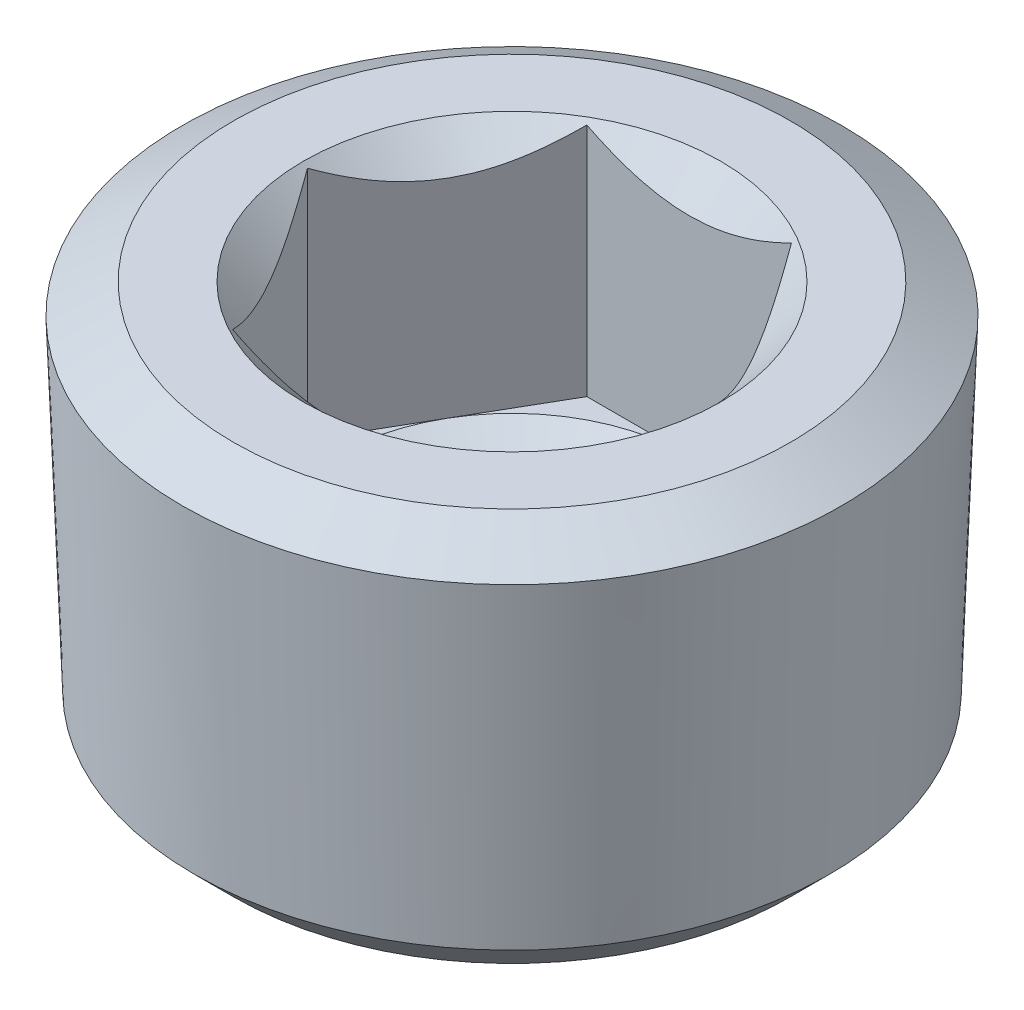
ISO-10303-21;
HEADER;
FILE_DESCRIPTION(('STEP AP214'),'2;1');
FILE_NAME('part.step','',(''),(''),'','','');
FILE_SCHEMA(('AUTOMOTIVE_DESIGN { 1 0 10303 214 1 1 1 1 }'));
ENDSEC;
DATA;
#1=APPLICATION_CONTEXT('core data for automotive mechanical design processes');
#2=APPLICATION_PROTOCOL_DEFINITION('international standard','automotive_design',2000,#1);
#3=PRODUCT_CONTEXT('',#1,'mechanical');
#4=PRODUCT('Part','Part','',(#3));
#5=PRODUCT_RELATED_PRODUCT_CATEGORY('part','',(#4));
#6=PRODUCT_DEFINITION_FORMATION('','',#4);
#7=PRODUCT_DEFINITION_CONTEXT('part definition',#1,'design');
#8=PRODUCT_DEFINITION('design','',#6,#7);
#9=PRODUCT_DEFINITION_SHAPE('','',#8);
#10=(LENGTH_UNIT() NAMED_UNIT(*) SI_UNIT(.MILLI.,.METRE.));
#11=(NAMED_UNIT(*) PLANE_ANGLE_UNIT() SI_UNIT($,.RADIAN.));
#12=(NAMED_UNIT(*) SI_UNIT($,.STERADIAN.) SOLID_ANGLE_UNIT());
#13=UNCERTAINTY_MEASURE_WITH_UNIT(LENGTH_MEASURE(1.E-05),#10,'distance_accuracy_value','');
#14=(GEOMETRIC_REPRESENTATION_CONTEXT(3) GLOBAL_UNCERTAINTY_ASSIGNED_CONTEXT((#13)) GLOBAL_UNIT_ASSIGNED_CONTEXT((#10,
#11,#12)) REPRESENTATION_CONTEXT('',''));
#15=CARTESIAN_POINT('',(0.,0.,0.));
#16=DIRECTION('',(0.,0.,1.));
#17=DIRECTION('',(1.,0.,0.));
#18=AXIS2_PLACEMENT_3D('',#15,#16,#17);
#19=CARTESIAN_POINT('',(0.,0.,0.));
#20=DIRECTION('',(0.,1.,0.));
#21=DIRECTION('',(0.,0.,1.));
#22=AXIS2_PLACEMENT_3D('',#19,#20,#21);
#23=PLANE('',#22);
#24=CARTESIAN_POINT('',(0.,0.,0.));
#25=DIRECTION('',(0.,1.,0.));
#26=DIRECTION('',(0.,0.,1.));
#27=AXIS2_PLACEMENT_3D('',#24,#25,#26);
#28=CIRCLE('',#27,8.41375);
#29=CARTESIAN_POINT('',(0.,0.,8.41375));
#30=VERTEX_POINT('',#29);
#31=EDGE_CURVE('E238',#30,#30,#28,.T.);
#32=ORIENTED_EDGE('',*,*,#31,.F.);
#33=EDGE_LOOP('',(#32));
#34=FACE_BOUND('',#33,.T.);
#35=CARTESIAN_POINT('',(0.,0.,0.));
#36=DIRECTION('',(0.,1.,0.));
#37=DIRECTION('',(0.,0.,1.));
#38=AXIS2_PLACEMENT_3D('',#35,#36,#37);
#39=CIRCLE('',#38,11.2322194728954);
#40=CARTESIAN_POINT('',(0.,0.,11.2322194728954));
#41=VERTEX_POINT('',#40);
#42=EDGE_CURVE('E12',#41,#41,#39,.T.);
#43=ORIENTED_EDGE('',*,*,#42,.T.);
#44=EDGE_LOOP('',(#43));
#45=FACE_BOUND('',#44,.T.);
#46=ADVANCED_FACE('F33',(#34,#45),#23,.T.);
#47=CARTESIAN_POINT('',(0.,0.,0.));
#48=DIRECTION('',(0.,-1.,0.));
#49=DIRECTION('',(0.,0.,-1.));
#50=AXIS2_PLACEMENT_3D('',#47,#48,#49);
#51=CONICAL_SURFACE('',#50,11.2322194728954,1.0471975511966);
#52=CARTESIAN_POINT('',(0.,-1.18901290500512,0.));
#53=DIRECTION('',(0.,1.,0.));
#54=DIRECTION('',(0.,0.,1.));
#55=AXIS2_PLACEMENT_3D('',#52,#53,#54);
#56=CIRCLE('',#55,13.2916502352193);
#57=CARTESIAN_POINT('',(0.,-1.18901290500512,13.2916502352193));
#58=VERTEX_POINT('',#57);
#59=EDGE_CURVE('E40',#58,#58,#56,.T.);
#60=ORIENTED_EDGE('',*,*,#59,.T.);
#61=EDGE_LOOP('',(#60));
#62=FACE_BOUND('',#61,.T.);
#63=ORIENTED_EDGE('',*,*,#42,.F.);
#64=EDGE_LOOP('',(#63));
#65=FACE_BOUND('',#64,.T.);
#66=ADVANCED_FACE('F228',(#62,#65),#51,.T.);
#67=CARTESIAN_POINT('',(0.,-1.18901290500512,0.));
#68=DIRECTION('',(0.,1.,0.));
#69=DIRECTION('',(0.,0.,1.));
#70=AXIS2_PLACEMENT_3D('',#67,#68,#69);
#71=CONICAL_SURFACE('',#70,13.2916502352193,0.0364424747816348);
#72=CARTESIAN_POINT('',(0.,-14.2933346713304,0.));
#73=DIRECTION('',(0.,1.,0.));
#74=DIRECTION('',(0.,0.,1.));
#75=AXIS2_PLACEMENT_3D('',#72,#73,#74);
#76=CIRCLE('',#75,12.813884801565);
#77=CARTESIAN_POINT('',(0.,-14.2933346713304,12.813884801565));
#78=VERTEX_POINT('',#77);
#79=EDGE_CURVE('E246',#78,#78,#76,.T.);
#80=ORIENTED_EDGE('',*,*,#79,.T.);
#81=EDGE_LOOP('',(#80));
#82=FACE_BOUND('',#81,.T.);
#83=ORIENTED_EDGE('',*,*,#59,.F.);
#84=EDGE_LOOP('',(#83));
#85=FACE_BOUND('',#84,.T.);
#86=ADVANCED_FACE('F233',(#82,#85),#71,.T.);
#87=CARTESIAN_POINT('',(0.,-14.2933346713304,0.));
#88=DIRECTION('',(0.,1.,0.));
#89=DIRECTION('',(0.,0.,1.));
#90=AXIS2_PLACEMENT_3D('',#87,#88,#89);
#91=CONICAL_SURFACE('',#90,12.813884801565,0.785398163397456);
#92=CARTESIAN_POINT('',(0.,-15.875,0.));
#93=DIRECTION('',(0.,1.,0.));
#94=DIRECTION('',(0.,0.,1.));
#95=AXIS2_PLACEMENT_3D('',#92,#93,#94);
#96=CIRCLE('',#95,11.2322194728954);
#97=CARTESIAN_POINT('',(0.,-15.875,11.2322194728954));
#98=VERTEX_POINT('',#97);
#99=EDGE_CURVE('E242',#98,#98,#96,.T.);
#100=ORIENTED_EDGE('',*,*,#99,.T.);
#101=EDGE_LOOP('',(#100));
#102=FACE_BOUND('',#101,.T.);
#103=ORIENTED_EDGE('',*,*,#79,.F.);
#104=EDGE_LOOP('',(#103));
#105=FACE_BOUND('',#104,.T.);
#106=ADVANCED_FACE('F257',(#102,#105),#91,.T.);
#107=CARTESIAN_POINT('',(-11.2322194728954,-15.875,0.));
#108=DIRECTION('',(0.,-1.,0.));
#109=DIRECTION('',(0.,0.,-1.));
#110=AXIS2_PLACEMENT_3D('',#107,#108,#109);
#111=PLANE('',#110);
#112=ORIENTED_EDGE('',*,*,#99,.F.);
#113=EDGE_LOOP('',(#112));
#114=FACE_BOUND('',#113,.T.);
#115=ADVANCED_FACE('F175',(#114),#111,.T.);
#116=CARTESIAN_POINT('',(0.,0.,0.));
#117=DIRECTION('',(0.,1.,0.));
#118=DIRECTION('',(0.,0.,1.));
#119=AXIS2_PLACEMENT_3D('',#116,#117,#118);
#120=CONICAL_SURFACE('',#119,8.41375,0.785398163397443);
#121=CARTESIAN_POINT('',(-8.67407425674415,2.82336387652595,7.14375));
#122=CARTESIAN_POINT('',(-8.46476721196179,2.66183323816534,7.14375));
#123=CARTESIAN_POINT('',(-8.25433999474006,2.50173141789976,7.14375));
#124=CARTESIAN_POINT('',(-7.83078466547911,2.18504039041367,7.14375));
#125=CARTESIAN_POINT('',(-7.61765593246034,2.02845201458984,7.14375));
#126=CARTESIAN_POINT('',(-7.18668039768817,1.71832876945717,7.14375));
#127=CARTESIAN_POINT('',(-6.96880989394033,1.56482673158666,7.14375));
#128=CARTESIAN_POINT('',(-6.52945609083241,1.26310103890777,7.14375));
#129=CARTESIAN_POINT('',(-6.30797304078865,1.11487702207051,7.14375));
#130=CARTESIAN_POINT('',(-5.84635573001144,0.815561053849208,7.14375));
#131=CARTESIAN_POINT('',(-5.60594002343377,0.664900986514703,7.14375));
#132=CARTESIAN_POINT('',(-5.11945866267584,0.372839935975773,7.14375));
#133=CARTESIAN_POINT('',(-4.87339205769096,0.231440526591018,7.14375));
#134=CARTESIAN_POINT('',(-4.37552614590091,-0.0390949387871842,7.14375));
#135=CARTESIAN_POINT('',(-4.12374654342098,-0.168266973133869,7.14375));
#136=CARTESIAN_POINT('',(-3.61302840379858,-0.411453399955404,7.14375));
#137=CARTESIAN_POINT('',(-3.35409333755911,-0.525474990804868,7.14375));
#138=CARTESIAN_POINT('',(-2.85518097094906,-0.723606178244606,7.14375));
#139=CARTESIAN_POINT('',(-2.61595074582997,-0.809577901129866,7.14375));
#140=CARTESIAN_POINT('',(-2.13133843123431,-0.962377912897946,7.14375));
#141=CARTESIAN_POINT('',(-1.88595595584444,-1.02920499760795,7.14375));
#142=CARTESIAN_POINT('',(-1.39481286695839,-1.13896092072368,7.14375));
#143=CARTESIAN_POINT('',(-1.14915190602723,-1.18232815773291,7.14375));
#144=CARTESIAN_POINT('',(-0.654704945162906,-1.24424979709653,7.14375));
#145=CARTESIAN_POINT('',(-0.405919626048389,-1.26280951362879,7.14375));
#146=CARTESIAN_POINT('',(0.080993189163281,-1.2735005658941,7.14375));
#147=CARTESIAN_POINT('',(0.319095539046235,-1.26678561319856,7.14375));
#148=CARTESIAN_POINT('',(0.793471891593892,-1.22996205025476,7.14375));
#149=CARTESIAN_POINT('',(1.02974572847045,-1.19985134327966,7.14375));
#150=CARTESIAN_POINT('',(1.50276174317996,-1.11743740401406,7.14375));
#151=CARTESIAN_POINT('',(1.73943403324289,-1.06473985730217,7.14375));
#152=CARTESIAN_POINT('',(2.20755573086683,-0.940095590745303,7.14375));
#153=CARTESIAN_POINT('',(2.43900540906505,-0.868149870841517,7.14375));
#154=CARTESIAN_POINT('',(2.90814144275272,-0.704039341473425,7.14375));
#155=CARTESIAN_POINT('',(3.1455239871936,-0.611016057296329,7.14375));
#156=CARTESIAN_POINT('',(3.61419107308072,-0.410586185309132,7.14375));
#157=CARTESIAN_POINT('',(3.84547282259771,-0.303173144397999,7.14375));
#158=CARTESIAN_POINT('',(4.30302519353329,-0.0765101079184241,7.14375));
#159=CARTESIAN_POINT('',(4.52927766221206,0.0427762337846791,7.14375));
#160=CARTESIAN_POINT('',(4.97660113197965,0.290562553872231,7.14375));
#161=CARTESIAN_POINT('',(5.19767292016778,0.41906112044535,7.14375));
#162=CARTESIAN_POINT('',(5.62451477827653,0.676952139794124,7.14375));
#163=CARTESIAN_POINT('',(5.83050164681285,0.805987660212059,7.14375));
#164=CARTESIAN_POINT('',(6.23893609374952,1.06955978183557,7.14375));
#165=CARTESIAN_POINT('',(6.44138340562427,1.20409679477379,7.14375));
#166=CARTESIAN_POINT('',(6.84157630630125,1.47659825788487,7.14375));
#167=CARTESIAN_POINT('',(7.03934657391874,1.6145265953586,7.14375));
#168=CARTESIAN_POINT('',(7.43217265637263,1.89408721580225,7.14375));
#169=CARTESIAN_POINT('',(7.62722920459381,2.03571846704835,7.14375));
#170=CARTESIAN_POINT('',(7.82114712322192,2.17886565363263,7.14375));
#171=B_SPLINE_CURVE_WITH_KNOTS('',3,(#121,#122,#123,#124,#125,#126,#127,#128,#129,#130,#131,
#132,#133,#134,#135,#136,#137,#138,#139,#140,#141,#142,#143,#144,#145,#146,#147,#148,#149,#150,
#151,#152,#153,#154,#155,#156,#157,#158,#159,#160,#161,#162,#163,#164,#165,#166,#167,#168,#169,
#170),.UNSPECIFIED.,.F.,.F.,(4,2,2,2,2,2,2,2,2,2,2,2,2,2,2,2,2,2,2,2,2,2,2,2,4),(0.,
0.793181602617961,1.58654895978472,2.38603037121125,3.18545683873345,4.03645697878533,
4.88760137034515,5.73615794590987,6.58430989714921,7.34628176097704,8.10830154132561,
8.85554086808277,9.60262009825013,10.3160198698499,11.029483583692,11.7559453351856,
12.4823693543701,13.2466600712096,14.0112946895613,14.7783465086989,15.545281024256,
16.2743746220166,17.0035228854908,17.7268271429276,18.4499319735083),.UNSPECIFIED.);
#172=CARTESIAN_POINT('',(4.12444598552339,-0.164858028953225,7.14375));
#173=VERTEX_POINT('',#172);
#174=CARTESIAN_POINT('',(-4.12444598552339,-0.164858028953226,7.14375));
#175=VERTEX_POINT('',#174);
#176=EDGE_CURVE('E47',#173,#175,#171,.F.);
#177=ORIENTED_EDGE('',*,*,#176,.T.);
#178=CARTESIAN_POINT('',(-4.12433051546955,-0.164742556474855,7.14395));
#179=CARTESIAN_POINT('',(-4.19524703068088,-0.235651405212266,7.02111899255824));
#180=CARTESIAN_POINT('',(-4.26670864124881,-0.304384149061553,6.89734385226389));
#181=CARTESIAN_POINT('',(-4.41082898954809,-0.436835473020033,6.64772008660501));
#182=CARTESIAN_POINT('',(-4.48348835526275,-0.500551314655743,6.52187037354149));
#183=CARTESIAN_POINT('',(-4.70409848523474,-0.683723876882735,6.13976241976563));
#184=CARTESIAN_POINT('',(-4.85391680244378,-0.794424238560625,5.88026948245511));
#185=CARTESIAN_POINT('',(-5.15603740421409,-0.983990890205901,5.35698125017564));
#186=CARTESIAN_POINT('',(-5.30826247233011,-1.0633347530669,5.09331969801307));
#187=CARTESIAN_POINT('',(-5.53910265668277,-1.15511604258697,4.69349277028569));
#188=CARTESIAN_POINT('',(-5.61638923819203,-1.18115844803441,4.55962848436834));
#189=CARTESIAN_POINT('',(-5.77161677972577,-1.22357578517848,4.2907664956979));
#190=CARTESIAN_POINT('',(-5.84955764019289,-1.23995216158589,4.1557689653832));
#191=CARTESIAN_POINT('',(-6.03948971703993,-1.26740960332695,3.82679695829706));
#192=CARTESIAN_POINT('',(-6.15168557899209,-1.27317058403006,3.63246802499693));
#193=CARTESIAN_POINT('',(-6.37587507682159,-1.26350037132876,3.24416042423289));
#194=CARTESIAN_POINT('',(-6.48786862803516,-1.24806174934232,3.05018190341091));
#195=CARTESIAN_POINT('',(-6.71079986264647,-1.19690237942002,2.66405367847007));
#196=CARTESIAN_POINT('',(-6.82173622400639,-1.16115895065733,2.47190626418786));
#197=CARTESIAN_POINT('',(-7.0417022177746,-1.07133320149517,2.09091398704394));
#198=CARTESIAN_POINT('',(-7.15073199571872,-1.01725228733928,1.90206887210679));
#199=CARTESIAN_POINT('',(-7.34427751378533,-0.905992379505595,1.56683820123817));
#200=CARTESIAN_POINT('',(-7.4292218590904,-0.851739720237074,1.41971027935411));
#201=CARTESIAN_POINT('',(-7.59758573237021,-0.734491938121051,1.1280954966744));
#202=CARTESIAN_POINT('',(-7.68100521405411,-0.671496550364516,0.983608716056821));
#203=CARTESIAN_POINT('',(-7.8460566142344,-0.538175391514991,0.69773130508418));
#204=CARTESIAN_POINT('',(-7.927693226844,-0.467872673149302,0.556332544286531));
#205=CARTESIAN_POINT('',(-8.08945480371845,-0.320859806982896,0.276153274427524));
#206=CARTESIAN_POINT('',(-8.16958065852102,-0.244153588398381,0.137371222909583));
#207=CARTESIAN_POINT('',(-8.24900744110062,-0.164742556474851,-0.000199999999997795));
#208=B_SPLINE_CURVE_WITH_KNOTS('',3,(#178,#179,#180,#181,#182,#183,#184,#185,#186,#187,#188,
#189,#190,#191,#192,#193,#194,#195,#196,#197,#198,#199,#200,#201,#202,#203,#204,#205,#206,#207),
.UNSPECIFIED.,.F.,.F.,(4,2,2,2,2,2,2,2,2,2,2,2,2,2,4),(0.,0.475684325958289,0.951626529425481,
1.90864918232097,2.85047554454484,3.32046508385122,3.79038435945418,4.46273505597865,
5.13532141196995,5.80866054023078,6.48194804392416,7.01672008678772,7.55150833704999,
8.08465792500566,8.61748274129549),.UNSPECIFIED.);
#209=CARTESIAN_POINT('',(-8.24889197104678,-0.164858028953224,0.));
#210=VERTEX_POINT('',#209);
#211=EDGE_CURVE('E119',#175,#210,#208,.T.);
#212=ORIENTED_EDGE('',*,*,#211,.T.);
#213=CARTESIAN_POINT('',(-8.24900744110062,-0.164742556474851,0.000200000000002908));
#214=CARTESIAN_POINT('',(-8.17809092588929,-0.235651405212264,-0.122631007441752));
#215=CARTESIAN_POINT('',(-8.10662931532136,-0.304384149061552,-0.246406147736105));
#216=CARTESIAN_POINT('',(-7.96250896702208,-0.436835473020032,-0.496029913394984));
#217=CARTESIAN_POINT('',(-7.88984960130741,-0.500551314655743,-0.621879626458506));
#218=CARTESIAN_POINT('',(-7.66923947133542,-0.683723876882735,-1.00398758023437));
#219=CARTESIAN_POINT('',(-7.51942115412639,-0.794424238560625,-1.26348051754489));
#220=CARTESIAN_POINT('',(-7.21730055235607,-0.983990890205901,-1.78676874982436));
#221=CARTESIAN_POINT('',(-7.06507548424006,-1.0633347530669,-2.05043030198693));
#222=CARTESIAN_POINT('',(-6.83423529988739,-1.15511604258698,-2.45025722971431));
#223=CARTESIAN_POINT('',(-6.75694871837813,-1.18115844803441,-2.58412151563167));
#224=CARTESIAN_POINT('',(-6.6017211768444,-1.22357578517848,-2.8529835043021));
#225=CARTESIAN_POINT('',(-6.52378031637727,-1.23995216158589,-2.9879810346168));
#226=CARTESIAN_POINT('',(-6.33384823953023,-1.26740960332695,-3.31695304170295));
#227=CARTESIAN_POINT('',(-6.22165237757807,-1.27317058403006,-3.51128197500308));
#228=CARTESIAN_POINT('',(-5.99746287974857,-1.26350037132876,-3.89958957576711));
#229=CARTESIAN_POINT('',(-5.885469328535,-1.24806174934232,-4.09356809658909));
#230=CARTESIAN_POINT('',(-5.6625380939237,-1.19690237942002,-4.47969632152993));
#231=CARTESIAN_POINT('',(-5.55160173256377,-1.16115895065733,-4.67184373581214));
#232=CARTESIAN_POINT('',(-5.33163573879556,-1.07133320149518,-5.05283601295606));
#233=CARTESIAN_POINT('',(-5.22260596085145,-1.01725228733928,-5.24168112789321));
#234=CARTESIAN_POINT('',(-5.02906044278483,-0.905992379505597,-5.57691179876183));
#235=CARTESIAN_POINT('',(-4.94411609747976,-0.851739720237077,-5.72403972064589));
#236=CARTESIAN_POINT('',(-4.77575222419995,-0.734491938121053,-6.01565450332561));
#237=CARTESIAN_POINT('',(-4.69233274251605,-0.671496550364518,-6.16014128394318));
#238=CARTESIAN_POINT('',(-4.52728134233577,-0.538175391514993,-6.44601869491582));
#239=CARTESIAN_POINT('',(-4.44564472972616,-0.467872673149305,-6.58741745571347));
#240=CARTESIAN_POINT('',(-4.28388315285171,-0.320859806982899,-6.86759672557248));
#241=CARTESIAN_POINT('',(-4.20375729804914,-0.244153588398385,-7.00637877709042));
#242=CARTESIAN_POINT('',(-4.12433051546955,-0.164742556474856,-7.14395));
#243=B_SPLINE_CURVE_WITH_KNOTS('',3,(#213,#214,#215,#216,#217,#218,#219,#220,#221,#222,#223,
#224,#225,#226,#227,#228,#229,#230,#231,#232,#233,#234,#235,#236,#237,#238,#239,#240,#241,#242),
.UNSPECIFIED.,.F.,.F.,(4,2,2,2,2,2,2,2,2,2,2,2,2,2,4),(0.,0.475684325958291,0.951626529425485,
1.90864918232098,2.85047554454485,3.32046508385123,3.79038435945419,4.46273505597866,
5.13532141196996,5.80866054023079,6.48194804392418,7.01672008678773,7.55150833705,
8.08465792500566,8.61748274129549),.UNSPECIFIED.);
#244=CARTESIAN_POINT('',(-4.12444598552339,-0.164858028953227,-7.14375));
#245=VERTEX_POINT('',#244);
#246=EDGE_CURVE('E197',#210,#245,#243,.T.);
#247=ORIENTED_EDGE('',*,*,#246,.T.);
#248=CARTESIAN_POINT('',(-8.67407425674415,2.82336387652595,-7.14375));
#249=CARTESIAN_POINT('',(-8.46476721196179,2.66183323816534,-7.14375));
#250=CARTESIAN_POINT('',(-8.25433999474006,2.50173141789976,-7.14375));
#251=CARTESIAN_POINT('',(-7.83078466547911,2.18504039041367,-7.14375));
#252=CARTESIAN_POINT('',(-7.61765593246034,2.02845201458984,-7.14375));
#253=CARTESIAN_POINT('',(-7.18668039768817,1.71832876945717,-7.14375));
#254=CARTESIAN_POINT('',(-6.96880989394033,1.56482673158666,-7.14375));
#255=CARTESIAN_POINT('',(-6.52945609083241,1.26310103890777,-7.14375));
#256=CARTESIAN_POINT('',(-6.30797304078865,1.11487702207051,-7.14375));
#257=CARTESIAN_POINT('',(-5.84635573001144,0.815561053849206,-7.14375));
#258=CARTESIAN_POINT('',(-5.60594002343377,0.664900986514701,-7.14375));
#259=CARTESIAN_POINT('',(-5.11945866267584,0.372839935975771,-7.14375));
#260=CARTESIAN_POINT('',(-4.87339205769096,0.231440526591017,-7.14375));
#261=CARTESIAN_POINT('',(-4.37552614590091,-0.0390949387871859,-7.14375));
#262=CARTESIAN_POINT('',(-4.12374654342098,-0.168266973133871,-7.14375));
#263=CARTESIAN_POINT('',(-3.61302840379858,-0.411453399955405,-7.14375));
#264=CARTESIAN_POINT('',(-3.35409333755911,-0.52547499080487,-7.14375));
#265=CARTESIAN_POINT('',(-2.85518097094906,-0.723606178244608,-7.14375));
#266=CARTESIAN_POINT('',(-2.61595074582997,-0.809577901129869,-7.14375));
#267=CARTESIAN_POINT('',(-2.13133843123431,-0.962377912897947,-7.14375));
#268=CARTESIAN_POINT('',(-1.88595595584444,-1.02920499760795,-7.14375));
#269=CARTESIAN_POINT('',(-1.39481286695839,-1.13896092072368,-7.14375));
#270=CARTESIAN_POINT('',(-1.14915190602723,-1.18232815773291,-7.14375));
#271=CARTESIAN_POINT('',(-0.654704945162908,-1.24424979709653,-7.14375));
#272=CARTESIAN_POINT('',(-0.405919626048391,-1.26280951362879,-7.14375));
#273=CARTESIAN_POINT('',(0.0809931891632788,-1.2735005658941,-7.14375));
#274=CARTESIAN_POINT('',(0.319095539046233,-1.26678561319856,-7.14375));
#275=CARTESIAN_POINT('',(0.793471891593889,-1.22996205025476,-7.14375));
#276=CARTESIAN_POINT('',(1.02974572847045,-1.19985134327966,-7.14375));
#277=CARTESIAN_POINT('',(1.50276174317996,-1.11743740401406,-7.14375));
#278=CARTESIAN_POINT('',(1.73943403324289,-1.06473985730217,-7.14375));
#279=CARTESIAN_POINT('',(2.20755573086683,-0.940095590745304,-7.14375));
#280=CARTESIAN_POINT('',(2.43900540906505,-0.868149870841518,-7.14375));
#281=CARTESIAN_POINT('',(2.90814144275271,-0.704039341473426,-7.14375));
#282=CARTESIAN_POINT('',(3.1455239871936,-0.611016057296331,-7.14375));
#283=CARTESIAN_POINT('',(3.61419107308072,-0.410586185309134,-7.14375));
#284=CARTESIAN_POINT('',(3.8454728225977,-0.303173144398,-7.14375));
#285=CARTESIAN_POINT('',(4.30302519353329,-0.0765101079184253,-7.14375));
#286=CARTESIAN_POINT('',(4.52927766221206,0.0427762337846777,-7.14375));
#287=CARTESIAN_POINT('',(4.97660113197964,0.290562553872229,-7.14375));
#288=CARTESIAN_POINT('',(5.19767292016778,0.419061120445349,-7.14375));
#289=CARTESIAN_POINT('',(5.62451477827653,0.676952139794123,-7.14375));
#290=CARTESIAN_POINT('',(5.83050164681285,0.805987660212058,-7.14375));
#291=CARTESIAN_POINT('',(6.23893609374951,1.06955978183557,-7.14375));
#292=CARTESIAN_POINT('',(6.44138340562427,1.20409679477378,-7.14375));
#293=CARTESIAN_POINT('',(6.84157630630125,1.47659825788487,-7.14375));
#294=CARTESIAN_POINT('',(7.03934657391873,1.6145265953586,-7.14375));
#295=CARTESIAN_POINT('',(7.43217265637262,1.89408721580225,-7.14375));
#296=CARTESIAN_POINT('',(7.62722920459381,2.03571846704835,-7.14375));
#297=CARTESIAN_POINT('',(7.82114712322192,2.17886565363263,-7.14375));
#298=B_SPLINE_CURVE_WITH_KNOTS('',3,(#248,#249,#250,#251,#252,#253,#254,#255,#256,#257,#258,
#259,#260,#261,#262,#263,#264,#265,#266,#267,#268,#269,#270,#271,#272,#273,#274,#275,#276,#277,
#278,#279,#280,#281,#282,#283,#284,#285,#286,#287,#288,#289,#290,#291,#292,#293,#294,#295,#296,
#297),.UNSPECIFIED.,.F.,.F.,(4,2,2,2,2,2,2,2,2,2,2,2,2,2,2,2,2,2,2,2,2,2,2,2,4),(0.,
0.79318160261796,1.58654895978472,2.38603037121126,3.18545683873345,4.03645697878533,
4.88760137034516,5.73615794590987,6.58430989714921,7.34628176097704,8.10830154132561,
8.85554086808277,9.60262009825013,10.3160198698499,11.029483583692,11.7559453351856,
12.4823693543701,13.2466600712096,14.0112946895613,14.7783465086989,15.545281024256,
16.2743746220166,17.0035228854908,17.7268271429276,18.4499319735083),.UNSPECIFIED.);
#299=CARTESIAN_POINT('',(4.12444598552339,-0.164858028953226,-7.14375));
#300=VERTEX_POINT('',#299);
#301=EDGE_CURVE('E191',#245,#300,#298,.T.);
#302=ORIENTED_EDGE('',*,*,#301,.T.);
#303=CARTESIAN_POINT('',(4.12433051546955,-0.164742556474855,-7.14395));
#304=CARTESIAN_POINT('',(4.19524703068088,-0.235651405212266,-7.02111899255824));
#305=CARTESIAN_POINT('',(4.26670864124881,-0.304384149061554,-6.89734385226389));
#306=CARTESIAN_POINT('',(4.41082898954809,-0.436835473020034,-6.64772008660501));
#307=CARTESIAN_POINT('',(4.48348835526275,-0.500551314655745,-6.52187037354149));
#308=CARTESIAN_POINT('',(4.70409848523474,-0.683723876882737,-6.13976241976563));
#309=CARTESIAN_POINT('',(4.85391680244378,-0.794424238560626,-5.88026948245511));
#310=CARTESIAN_POINT('',(5.15603740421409,-0.983990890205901,-5.35698125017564));
#311=CARTESIAN_POINT('',(5.30826247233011,-1.0633347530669,-5.09331969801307));
#312=CARTESIAN_POINT('',(5.53910265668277,-1.15511604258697,-4.69349277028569));
#313=CARTESIAN_POINT('',(5.61638923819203,-1.18115844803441,-4.55962848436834));
#314=CARTESIAN_POINT('',(5.77161677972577,-1.22357578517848,-4.2907664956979));
#315=CARTESIAN_POINT('',(5.84955764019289,-1.23995216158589,-4.15576896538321));
#316=CARTESIAN_POINT('',(6.03948971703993,-1.26740960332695,-3.82679695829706));
#317=CARTESIAN_POINT('',(6.15168557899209,-1.27317058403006,-3.63246802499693));
#318=CARTESIAN_POINT('',(6.37587507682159,-1.26350037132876,-3.24416042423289));
#319=CARTESIAN_POINT('',(6.48786862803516,-1.24806174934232,-3.05018190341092));
#320=CARTESIAN_POINT('',(6.71079986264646,-1.19690237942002,-2.66405367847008));
#321=CARTESIAN_POINT('',(6.82173622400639,-1.16115895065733,-2.47190626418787));
#322=CARTESIAN_POINT('',(7.0417022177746,-1.07133320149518,-2.09091398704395));
#323=CARTESIAN_POINT('',(7.15073199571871,-1.01725228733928,-1.90206887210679));
#324=CARTESIAN_POINT('',(7.34427751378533,-0.905992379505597,-1.56683820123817));
#325=CARTESIAN_POINT('',(7.4292218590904,-0.851739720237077,-1.41971027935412));
#326=CARTESIAN_POINT('',(7.59758573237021,-0.734491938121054,-1.1280954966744));
#327=CARTESIAN_POINT('',(7.68100521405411,-0.671496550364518,-0.983608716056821));
#328=CARTESIAN_POINT('',(7.8460566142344,-0.538175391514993,-0.697731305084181));
#329=CARTESIAN_POINT('',(7.927693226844,-0.467872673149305,-0.556332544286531));
#330=CARTESIAN_POINT('',(8.08945480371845,-0.320859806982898,-0.276153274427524));
#331=CARTESIAN_POINT('',(8.16958065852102,-0.244153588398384,-0.137371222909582));
#332=CARTESIAN_POINT('',(8.24900744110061,-0.164742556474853,0.000199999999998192));
#333=B_SPLINE_CURVE_WITH_KNOTS('',3,(#303,#304,#305,#306,#307,#308,#309,#310,#311,#312,#313,
#314,#315,#316,#317,#318,#319,#320,#321,#322,#323,#324,#325,#326,#327,#328,#329,#330,#331,#332),
.UNSPECIFIED.,.F.,.F.,(4,2,2,2,2,2,2,2,2,2,2,2,2,2,4),(0.,0.47568432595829,0.951626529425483,
1.90864918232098,2.85047554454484,3.32046508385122,3.79038435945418,4.46273505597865,
5.13532141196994,5.80866054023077,6.48194804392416,7.01672008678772,7.55150833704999,
8.08465792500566,8.61748274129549),.UNSPECIFIED.);
#334=CARTESIAN_POINT('',(8.24889197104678,-0.164858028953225,0.));
#335=VERTEX_POINT('',#334);
#336=EDGE_CURVE('E185',#300,#335,#333,.T.);
#337=ORIENTED_EDGE('',*,*,#336,.T.);
#338=CARTESIAN_POINT('',(8.24900744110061,-0.164742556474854,-0.000200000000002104));
#339=CARTESIAN_POINT('',(8.17809092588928,-0.235651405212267,0.122631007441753));
#340=CARTESIAN_POINT('',(8.10662931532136,-0.304384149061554,0.246406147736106));
#341=CARTESIAN_POINT('',(7.96250896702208,-0.436835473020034,0.496029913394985));
#342=CARTESIAN_POINT('',(7.88984960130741,-0.500551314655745,0.621879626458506));
#343=CARTESIAN_POINT('',(7.66923947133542,-0.683723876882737,1.00398758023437));
#344=CARTESIAN_POINT('',(7.51942115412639,-0.794424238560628,1.26348051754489));
#345=CARTESIAN_POINT('',(7.21730055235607,-0.983990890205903,1.78676874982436));
#346=CARTESIAN_POINT('',(7.06507548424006,-1.0633347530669,2.05043030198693));
#347=CARTESIAN_POINT('',(6.83423529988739,-1.15511604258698,2.45025722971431));
#348=CARTESIAN_POINT('',(6.75694871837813,-1.18115844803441,2.58412151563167));
#349=CARTESIAN_POINT('',(6.6017211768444,-1.22357578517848,2.8529835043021));
#350=CARTESIAN_POINT('',(6.52378031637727,-1.23995216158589,2.9879810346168));
#351=CARTESIAN_POINT('',(6.33384823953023,-1.26740960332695,3.31695304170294));
#352=CARTESIAN_POINT('',(6.22165237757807,-1.27317058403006,3.51128197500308));
#353=CARTESIAN_POINT('',(5.99746287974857,-1.26350037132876,3.89958957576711));
#354=CARTESIAN_POINT('',(5.885469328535,-1.24806174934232,4.09356809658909));
#355=CARTESIAN_POINT('',(5.6625380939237,-1.19690237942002,4.47969632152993));
#356=CARTESIAN_POINT('',(5.55160173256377,-1.16115895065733,4.67184373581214));
#357=CARTESIAN_POINT('',(5.33163573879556,-1.07133320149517,5.05283601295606));
#358=CARTESIAN_POINT('',(5.22260596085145,-1.01725228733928,5.24168112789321));
#359=CARTESIAN_POINT('',(5.02906044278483,-0.905992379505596,5.57691179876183));
#360=CARTESIAN_POINT('',(4.94411609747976,-0.851739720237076,5.72403972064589));
#361=CARTESIAN_POINT('',(4.77575222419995,-0.734491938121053,6.01565450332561));
#362=CARTESIAN_POINT('',(4.69233274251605,-0.671496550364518,6.16014128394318));
#363=CARTESIAN_POINT('',(4.52728134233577,-0.538175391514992,6.44601869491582));
#364=CARTESIAN_POINT('',(4.44564472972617,-0.467872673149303,6.58741745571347));
#365=CARTESIAN_POINT('',(4.28388315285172,-0.320859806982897,6.86759672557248));
#366=CARTESIAN_POINT('',(4.20375729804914,-0.244153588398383,7.00637877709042));
#367=CARTESIAN_POINT('',(4.12433051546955,-0.164742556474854,7.14395));
#368=B_SPLINE_CURVE_WITH_KNOTS('',3,(#338,#339,#340,#341,#342,#343,#344,#345,#346,#347,#348,
#349,#350,#351,#352,#353,#354,#355,#356,#357,#358,#359,#360,#361,#362,#363,#364,#365,#366,#367),
.UNSPECIFIED.,.F.,.F.,(4,2,2,2,2,2,2,2,2,2,2,2,2,2,4),(0.,0.47568432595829,0.951626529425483,
1.90864918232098,2.85047554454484,3.32046508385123,3.79038435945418,4.46273505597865,
5.13532141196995,5.80866054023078,6.48194804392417,7.01672008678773,7.55150833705,
8.08465792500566,8.61748274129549),.UNSPECIFIED.);
#369=EDGE_CURVE('E162',#335,#173,#368,.T.);
#370=ORIENTED_EDGE('',*,*,#369,.T.);
#371=EDGE_LOOP('',(#177,#212,#247,#302,#337,#370));
#372=FACE_BOUND('',#371,.T.);
#373=ORIENTED_EDGE('',*,*,#31,.T.);
#374=EDGE_LOOP('',(#373));
#375=FACE_BOUND('',#374,.T.);
#376=ADVANCED_FACE('F170',(#372,#375),#120,.F.);
#377=CARTESIAN_POINT('',(-8.24889197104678,-9.652,0.));
#378=DIRECTION('',(-0.866025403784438,0.,0.5));
#379=DIRECTION('',(0.5,0.,0.866025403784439));
#380=AXIS2_PLACEMENT_3D('',#377,#378,#379);
#381=PLANE('',#380);
#382=DIRECTION('',(0.,1.,0.));
#383=VECTOR('',#382,1.);
#384=CARTESIAN_POINT('',(-4.12444598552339,-9.652,7.14375));
#385=LINE('',#384,#383);
#386=CARTESIAN_POINT('',(-4.12444598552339,-9.652,7.14375));
#387=VERTEX_POINT('',#386);
#388=EDGE_CURVE('E116',#387,#175,#385,.T.);
#389=ORIENTED_EDGE('',*,*,#388,.F.);
#390=DIRECTION('',(0.5,0.,0.866025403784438));
#391=VECTOR('',#390,1.);
#392=CARTESIAN_POINT('',(-8.24889197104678,-9.652,0.));
#393=LINE('',#392,#391);
#394=CARTESIAN_POINT('',(-6.18666897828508,-9.652,3.571875));
#395=VERTEX_POINT('',#394);
#396=EDGE_CURVE('E103',#395,#387,#393,.T.);
#397=ORIENTED_EDGE('',*,*,#396,.F.);
#398=CARTESIAN_POINT('',(-8.24889197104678,-9.652,0.));
#399=VERTEX_POINT('',#398);
#400=EDGE_CURVE('E113',#399,#395,#393,.T.);
#401=ORIENTED_EDGE('',*,*,#400,.F.);
#402=DIRECTION('',(0.,1.,0.));
#403=VECTOR('',#402,1.);
#404=CARTESIAN_POINT('',(-8.24889197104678,-9.652,0.));
#405=LINE('',#404,#403);
#406=EDGE_CURVE('E143',#399,#210,#405,.T.);
#407=ORIENTED_EDGE('',*,*,#406,.T.);
#408=ORIENTED_EDGE('',*,*,#211,.F.);
#409=EDGE_LOOP('',(#389,#397,#401,#407,#408));
#410=FACE_BOUND('',#409,.T.);
#411=ADVANCED_FACE('F117',(#410),#381,.F.);
#412=CARTESIAN_POINT('',(-4.12444598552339,-9.652,-7.14375));
#413=DIRECTION('',(-0.866025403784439,0.,-0.5));
#414=DIRECTION('',(-0.5,0.,0.866025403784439));
#415=AXIS2_PLACEMENT_3D('',#412,#413,#414);
#416=PLANE('',#415);
#417=ORIENTED_EDGE('',*,*,#406,.F.);
#418=DIRECTION('',(-0.5,0.,0.866025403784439));
#419=VECTOR('',#418,1.);
#420=CARTESIAN_POINT('',(-4.12444598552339,-9.652,-7.14375));
#421=LINE('',#420,#419);
#422=CARTESIAN_POINT('',(-6.18666897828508,-9.652,-3.571875));
#423=VERTEX_POINT('',#422);
#424=EDGE_CURVE('E140',#423,#399,#421,.T.);
#425=ORIENTED_EDGE('',*,*,#424,.F.);
#426=CARTESIAN_POINT('',(-4.12444598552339,-9.652,-7.14375));
#427=VERTEX_POINT('',#426);
#428=EDGE_CURVE('E122',#427,#423,#421,.T.);
#429=ORIENTED_EDGE('',*,*,#428,.F.);
#430=DIRECTION('',(0.,1.,0.));
#431=VECTOR('',#430,1.);
#432=CARTESIAN_POINT('',(-4.12444598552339,-9.652,-7.14375));
#433=LINE('',#432,#431);
#434=EDGE_CURVE('E145',#427,#245,#433,.T.);
#435=ORIENTED_EDGE('',*,*,#434,.T.);
#436=ORIENTED_EDGE('',*,*,#246,.F.);
#437=EDGE_LOOP('',(#417,#425,#429,#435,#436));
#438=FACE_BOUND('',#437,.T.);
#439=ADVANCED_FACE('F206',(#438),#416,.F.);
#440=CARTESIAN_POINT('',(4.12444598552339,-9.652,-7.14375));
#441=DIRECTION('',(0.,0.,-1.));
#442=DIRECTION('',(-1.,0.,0.));
#443=AXIS2_PLACEMENT_3D('',#440,#441,#442);
#444=PLANE('',#443);
#445=ORIENTED_EDGE('',*,*,#434,.F.);
#446=DIRECTION('',(-1.,0.,0.));
#447=VECTOR('',#446,1.);
#448=CARTESIAN_POINT('',(4.12444598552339,-9.652,-7.14375));
#449=LINE('',#448,#447);
#450=CARTESIAN_POINT('',(0.,-9.652,-7.14375));
#451=VERTEX_POINT('',#450);
#452=EDGE_CURVE('E136',#451,#427,#449,.T.);
#453=ORIENTED_EDGE('',*,*,#452,.F.);
#454=CARTESIAN_POINT('',(4.12444598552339,-9.652,-7.14375));
#455=VERTEX_POINT('',#454);
#456=EDGE_CURVE('E137',#455,#451,#449,.T.);
#457=ORIENTED_EDGE('',*,*,#456,.F.);
#458=DIRECTION('',(0.,1.,0.));
#459=VECTOR('',#458,1.);
#460=CARTESIAN_POINT('',(4.12444598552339,-9.652,-7.14375));
#461=LINE('',#460,#459);
#462=EDGE_CURVE('E148',#455,#300,#461,.T.);
#463=ORIENTED_EDGE('',*,*,#462,.T.);
#464=ORIENTED_EDGE('',*,*,#301,.F.);
#465=EDGE_LOOP('',(#445,#453,#457,#463,#464));
#466=FACE_BOUND('',#465,.T.);
#467=ADVANCED_FACE('F210',(#466),#444,.F.);
#468=CARTESIAN_POINT('',(8.24889197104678,-9.652,0.));
#469=DIRECTION('',(0.866025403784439,0.,-0.5));
#470=DIRECTION('',(-0.5,0.,-0.866025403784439));
#471=AXIS2_PLACEMENT_3D('',#468,#469,#470);
#472=PLANE('',#471);
#473=ORIENTED_EDGE('',*,*,#462,.F.);
#474=DIRECTION('',(-0.5,0.,-0.866025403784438));
#475=VECTOR('',#474,1.);
#476=CARTESIAN_POINT('',(8.24889197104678,-9.652,0.));
#477=LINE('',#476,#475);
#478=CARTESIAN_POINT('',(6.18666897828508,-9.652,-3.571875));
#479=VERTEX_POINT('',#478);
#480=EDGE_CURVE('E132',#479,#455,#477,.T.);
#481=ORIENTED_EDGE('',*,*,#480,.F.);
#482=CARTESIAN_POINT('',(8.24889197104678,-9.652,0.));
#483=VERTEX_POINT('',#482);
#484=EDGE_CURVE('E133',#483,#479,#477,.T.);
#485=ORIENTED_EDGE('',*,*,#484,.F.);
#486=DIRECTION('',(0.,1.,0.));
#487=VECTOR('',#486,1.);
#488=CARTESIAN_POINT('',(8.24889197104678,-9.652,0.));
#489=LINE('',#488,#487);
#490=EDGE_CURVE('E151',#483,#335,#489,.T.);
#491=ORIENTED_EDGE('',*,*,#490,.T.);
#492=ORIENTED_EDGE('',*,*,#336,.F.);
#493=EDGE_LOOP('',(#473,#481,#485,#491,#492));
#494=FACE_BOUND('',#493,.T.);
#495=ADVANCED_FACE('F214',(#494),#472,.F.);
#496=CARTESIAN_POINT('',(4.12444598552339,-9.652,7.14375));
#497=DIRECTION('',(0.866025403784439,0.,0.5));
#498=DIRECTION('',(0.5,0.,-0.866025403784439));
#499=AXIS2_PLACEMENT_3D('',#496,#497,#498);
#500=PLANE('',#499);
#501=ORIENTED_EDGE('',*,*,#490,.F.);
#502=DIRECTION('',(0.5,0.,-0.866025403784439));
#503=VECTOR('',#502,1.);
#504=CARTESIAN_POINT('',(4.12444598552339,-9.652,7.14375));
#505=LINE('',#504,#503);
#506=CARTESIAN_POINT('',(6.18666897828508,-9.652,3.571875));
#507=VERTEX_POINT('',#506);
#508=EDGE_CURVE('E128',#507,#483,#505,.T.);
#509=ORIENTED_EDGE('',*,*,#508,.F.);
#510=CARTESIAN_POINT('',(4.12444598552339,-9.652,7.14375));
#511=VERTEX_POINT('',#510);
#512=EDGE_CURVE('E55',#511,#507,#505,.T.);
#513=ORIENTED_EDGE('',*,*,#512,.F.);
#514=DIRECTION('',(0.,1.,0.));
#515=VECTOR('',#514,1.);
#516=CARTESIAN_POINT('',(4.12444598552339,-9.652,7.14375));
#517=LINE('',#516,#515);
#518=EDGE_CURVE('E121',#511,#173,#517,.T.);
#519=ORIENTED_EDGE('',*,*,#518,.T.);
#520=ORIENTED_EDGE('',*,*,#369,.F.);
#521=EDGE_LOOP('',(#501,#509,#513,#519,#520));
#522=FACE_BOUND('',#521,.T.);
#523=ADVANCED_FACE('F218',(#522),#500,.F.);
#524=CARTESIAN_POINT('',(-4.12444598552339,-9.652,7.14375));
#525=DIRECTION('',(0.,0.,1.));
#526=DIRECTION('',(1.,0.,0.));
#527=AXIS2_PLACEMENT_3D('',#524,#525,#526);
#528=PLANE('',#527);
#529=ORIENTED_EDGE('',*,*,#518,.F.);
#530=DIRECTION('',(1.,0.,0.));
#531=VECTOR('',#530,1.);
#532=CARTESIAN_POINT('',(-4.12444598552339,-9.652,7.14375));
#533=LINE('',#532,#531);
#534=CARTESIAN_POINT('',(0.,-9.652,7.14375));
#535=VERTEX_POINT('',#534);
#536=EDGE_CURVE('E127',#535,#511,#533,.T.);
#537=ORIENTED_EDGE('',*,*,#536,.F.);
#538=EDGE_CURVE('E107',#387,#535,#533,.T.);
#539=ORIENTED_EDGE('',*,*,#538,.F.);
#540=ORIENTED_EDGE('',*,*,#388,.T.);
#541=ORIENTED_EDGE('',*,*,#176,.F.);
#542=EDGE_LOOP('',(#529,#537,#539,#540,#541));
#543=FACE_BOUND('',#542,.T.);
#544=ADVANCED_FACE('F126',(#543),#528,.F.);
#545=CARTESIAN_POINT('',(0.,-9.652,0.));
#546=DIRECTION('',(0.,1.,0.));
#547=DIRECTION('',(0.,0.,1.));
#548=AXIS2_PLACEMENT_3D('',#545,#546,#547);
#549=PLANE('',#548);
#550=CARTESIAN_POINT('',(0.,-9.652,0.));
#551=DIRECTION('',(0.,1.,0.));
#552=DIRECTION('',(0.,0.,1.));
#553=AXIS2_PLACEMENT_3D('',#550,#551,#552);
#554=CIRCLE('',#553,7.14375);
#555=EDGE_CURVE('E109',#395,#535,#554,.T.);
#556=ORIENTED_EDGE('',*,*,#555,.F.);
#557=ORIENTED_EDGE('',*,*,#396,.T.);
#558=ORIENTED_EDGE('',*,*,#538,.T.);
#559=EDGE_LOOP('',(#556,#557,#558));
#560=FACE_BOUND('',#559,.T.);
#561=ADVANCED_FACE('F105',(#560),#549,.T.);
#562=EDGE_CURVE('E408',#423,#395,#554,.T.);
#563=ORIENTED_EDGE('',*,*,#562,.F.);
#564=ORIENTED_EDGE('',*,*,#424,.T.);
#565=ORIENTED_EDGE('',*,*,#400,.T.);
#566=EDGE_LOOP('',(#563,#564,#565));
#567=FACE_BOUND('',#566,.T.);
#568=ADVANCED_FACE('F314',(#567),#549,.T.);
#569=EDGE_CURVE('E419',#451,#423,#554,.T.);
#570=ORIENTED_EDGE('',*,*,#569,.F.);
#571=ORIENTED_EDGE('',*,*,#452,.T.);
#572=ORIENTED_EDGE('',*,*,#428,.T.);
#573=EDGE_LOOP('',(#570,#571,#572));
#574=FACE_BOUND('',#573,.T.);
#575=ADVANCED_FACE('F323',(#574),#549,.T.);
#576=EDGE_CURVE('E420',#479,#451,#554,.T.);
#577=ORIENTED_EDGE('',*,*,#576,.F.);
#578=ORIENTED_EDGE('',*,*,#480,.T.);
#579=ORIENTED_EDGE('',*,*,#456,.T.);
#580=EDGE_LOOP('',(#577,#578,#579));
#581=FACE_BOUND('',#580,.T.);
#582=ADVANCED_FACE('F332',(#581),#549,.T.);
#583=EDGE_CURVE('E249',#507,#479,#554,.T.);
#584=ORIENTED_EDGE('',*,*,#583,.F.);
#585=ORIENTED_EDGE('',*,*,#508,.T.);
#586=ORIENTED_EDGE('',*,*,#484,.T.);
#587=EDGE_LOOP('',(#584,#585,#586));
#588=FACE_BOUND('',#587,.T.);
#589=ADVANCED_FACE('F341',(#588),#549,.T.);
#590=EDGE_CURVE('E243',#535,#507,#554,.T.);
#591=ORIENTED_EDGE('',*,*,#590,.F.);
#592=ORIENTED_EDGE('',*,*,#536,.T.);
#593=ORIENTED_EDGE('',*,*,#512,.T.);
#594=EDGE_LOOP('',(#591,#592,#593));
#595=FACE_BOUND('',#594,.T.);
#596=ADVANCED_FACE('F315',(#595),#549,.T.);
#597=CARTESIAN_POINT('',(-2.91648011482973,-12.192,0.));
#598=DIRECTION('',(0.,-1.,0.));
#599=DIRECTION('',(0.,0.,-1.));
#600=AXIS2_PLACEMENT_3D('',#597,#598,#599);
#601=PLANE('',#600);
#602=CARTESIAN_POINT('',(0.,-12.192,0.));
#603=DIRECTION('',(0.,1.,0.));
#604=DIRECTION('',(0.,0.,1.));
#605=AXIS2_PLACEMENT_3D('',#602,#603,#604);
#606=CIRCLE('',#605,2.91648011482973);
#607=CARTESIAN_POINT('',(0.,-12.192,2.91648011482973));
#608=VERTEX_POINT('',#607);
#609=EDGE_CURVE('E407',#608,#608,#606,.T.);
#610=ORIENTED_EDGE('',*,*,#609,.T.);
#611=EDGE_LOOP('',(#610));
#612=FACE_BOUND('',#611,.T.);
#613=ADVANCED_FACE('F358',(#612),#601,.F.);
#614=CARTESIAN_POINT('',(0.,-9.652,0.));
#615=DIRECTION('',(0.,1.,0.));
#616=DIRECTION('',(0.,0.,1.));
#617=AXIS2_PLACEMENT_3D('',#614,#615,#616);
#618=CONICAL_SURFACE('',#617,7.14375,1.02974425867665);
#619=ORIENTED_EDGE('',*,*,#609,.F.);
#620=EDGE_LOOP('',(#619));
#621=FACE_BOUND('',#620,.T.);
#622=ORIENTED_EDGE('',*,*,#590,.T.);
#623=ORIENTED_EDGE('',*,*,#583,.T.);
#624=ORIENTED_EDGE('',*,*,#576,.T.);
#625=ORIENTED_EDGE('',*,*,#569,.T.);
#626=ORIENTED_EDGE('',*,*,#562,.T.);
#627=ORIENTED_EDGE('',*,*,#555,.T.);
#628=EDGE_LOOP('',(#622,#623,#624,#625,#626,#627));
#629=FACE_BOUND('',#628,.T.);
#630=ADVANCED_FACE('F176',(#621,#629),#618,.F.);
#631=CLOSED_SHELL('',(#46,#66,#86,#106,#115,#376,#411,#439,#467,#495,#523,#544,#561,#568,#575,
#582,#589,#596,#613,#630));
#632=MANIFOLD_SOLID_BREP('B2',#631);
#633=ADVANCED_BREP_SHAPE_REPRESENTATION('',(#18,#632),#14);
#634=SHAPE_DEFINITION_REPRESENTATION(#9,#633);
ENDSEC;
END-ISO-10303-21;
